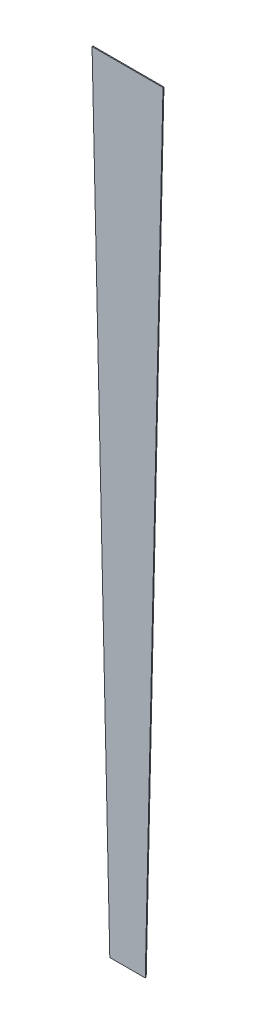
from build123d import *

# Parameters (mm, degrees)
BOSS_EXTRUDE1_DEPTH = 1.016


with BuildPart() as part:
    # Sketch1 → Boss-Extrude1 (new body)
    with BuildSketch(Plane.XY):
        Polygon((0, 0), (38.1, 0), (19.05, -838.2), (-19.05, -838.2), (-38.1, 0), align=None)
    extrude(amount=BOSS_EXTRUDE1_DEPTH)


solid = part.part
